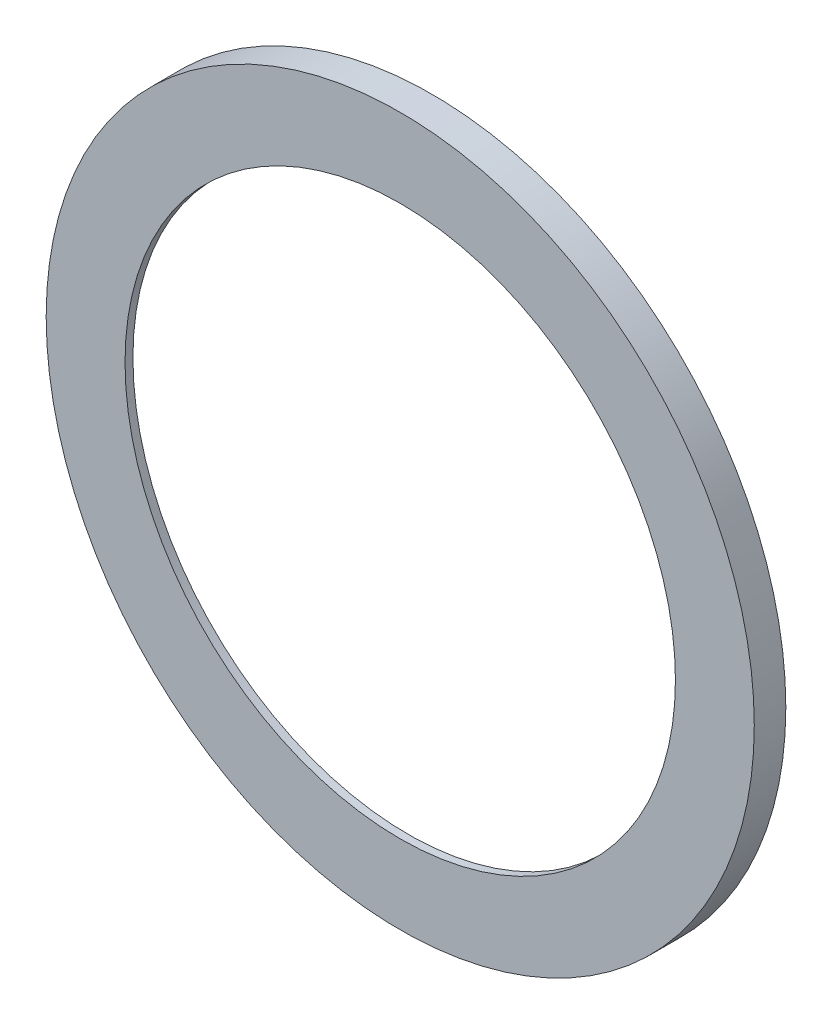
ISO-10303-21;
HEADER;
FILE_DESCRIPTION(('STEP AP214'),'2;1');
FILE_NAME('part.step','',(''),(''),'','','');
FILE_SCHEMA(('AUTOMOTIVE_DESIGN { 1 0 10303 214 1 1 1 1 }'));
ENDSEC;
DATA;
#1=APPLICATION_CONTEXT('core data for automotive mechanical design processes');
#2=APPLICATION_PROTOCOL_DEFINITION('international standard','automotive_design',2000,#1);
#3=PRODUCT_CONTEXT('',#1,'mechanical');
#4=PRODUCT('Part','Part','',(#3));
#5=PRODUCT_RELATED_PRODUCT_CATEGORY('part','',(#4));
#6=PRODUCT_DEFINITION_FORMATION('','',#4);
#7=PRODUCT_DEFINITION_CONTEXT('part definition',#1,'design');
#8=PRODUCT_DEFINITION('design','',#6,#7);
#9=PRODUCT_DEFINITION_SHAPE('','',#8);
#10=(LENGTH_UNIT() NAMED_UNIT(*) SI_UNIT(.MILLI.,.METRE.));
#11=(NAMED_UNIT(*) PLANE_ANGLE_UNIT() SI_UNIT($,.RADIAN.));
#12=(NAMED_UNIT(*) SI_UNIT($,.STERADIAN.) SOLID_ANGLE_UNIT());
#13=UNCERTAINTY_MEASURE_WITH_UNIT(LENGTH_MEASURE(1.E-05),#10,'distance_accuracy_value','');
#14=(GEOMETRIC_REPRESENTATION_CONTEXT(3) GLOBAL_UNCERTAINTY_ASSIGNED_CONTEXT((#13)) GLOBAL_UNIT_ASSIGNED_CONTEXT((#10,
#11,#12)) REPRESENTATION_CONTEXT('',''));
#15=CARTESIAN_POINT('',(0.,0.,0.));
#16=DIRECTION('',(0.,0.,1.));
#17=DIRECTION('',(1.,0.,0.));
#18=AXIS2_PLACEMENT_3D('',#15,#16,#17);
#19=CARTESIAN_POINT('',(0.,0.,20.));
#20=DIRECTION('',(0.,0.,-1.));
#21=DIRECTION('',(-1.,0.,0.));
#22=AXIS2_PLACEMENT_3D('',#19,#20,#21);
#23=CYLINDRICAL_SURFACE('',#22,174.5);
#24=CARTESIAN_POINT('',(0.,0.,20.));
#25=DIRECTION('',(0.,0.,1.));
#26=DIRECTION('',(1.,0.,0.));
#27=AXIS2_PLACEMENT_3D('',#24,#25,#26);
#28=CIRCLE('',#27,174.5);
#29=CARTESIAN_POINT('',(174.5,0.,20.));
#30=VERTEX_POINT('',#29);
#31=EDGE_CURVE('E39',#30,#30,#28,.T.);
#32=ORIENTED_EDGE('',*,*,#31,.T.);
#33=EDGE_LOOP('',(#32));
#34=FACE_BOUND('',#33,.T.);
#35=CARTESIAN_POINT('',(0.,0.,15.));
#36=DIRECTION('',(0.,0.,-1.));
#37=DIRECTION('',(-1.,0.,0.));
#38=AXIS2_PLACEMENT_3D('',#35,#36,#37);
#39=CIRCLE('',#38,174.5);
#40=CARTESIAN_POINT('',(-174.5,0.,15.));
#41=VERTEX_POINT('',#40);
#42=EDGE_CURVE('E47',#41,#41,#39,.T.);
#43=ORIENTED_EDGE('',*,*,#42,.T.);
#44=EDGE_LOOP('',(#43));
#45=FACE_BOUND('',#44,.T.);
#46=ADVANCED_FACE('F28',(#34,#45),#23,.F.);
#47=CARTESIAN_POINT('',(0.,0.,20.));
#48=DIRECTION('',(0.,0.,1.));
#49=DIRECTION('',(1.,0.,0.));
#50=AXIS2_PLACEMENT_3D('',#47,#48,#49);
#51=PLANE('',#50);
#52=CARTESIAN_POINT('',(0.,0.,20.));
#53=DIRECTION('',(0.,0.,1.));
#54=DIRECTION('',(1.,0.,0.));
#55=AXIS2_PLACEMENT_3D('',#52,#53,#54);
#56=CIRCLE('',#55,224.5);
#57=CARTESIAN_POINT('',(224.5,0.,20.));
#58=VERTEX_POINT('',#57);
#59=EDGE_CURVE('E10',#58,#58,#56,.T.);
#60=ORIENTED_EDGE('',*,*,#59,.T.);
#61=EDGE_LOOP('',(#60));
#62=FACE_BOUND('',#61,.T.);
#63=ORIENTED_EDGE('',*,*,#31,.F.);
#64=EDGE_LOOP('',(#63));
#65=FACE_BOUND('',#64,.T.);
#66=ADVANCED_FACE('F69',(#62,#65),#51,.T.);
#67=CARTESIAN_POINT('',(0.,0.,0.));
#68=DIRECTION('',(0.,0.,1.));
#69=DIRECTION('',(1.,0.,0.));
#70=AXIS2_PLACEMENT_3D('',#67,#68,#69);
#71=PLANE('',#70);
#72=CARTESIAN_POINT('',(0.,0.,0.));
#73=DIRECTION('',(0.,0.,-1.));
#74=DIRECTION('',(-1.,0.,0.));
#75=AXIS2_PLACEMENT_3D('',#72,#73,#74);
#76=CIRCLE('',#75,222.);
#77=CARTESIAN_POINT('',(-222.,0.,0.));
#78=VERTEX_POINT('',#77);
#79=EDGE_CURVE('E44',#78,#78,#76,.T.);
#80=ORIENTED_EDGE('',*,*,#79,.F.);
#81=EDGE_LOOP('',(#80));
#82=FACE_BOUND('',#81,.T.);
#83=CARTESIAN_POINT('',(0.,0.,0.));
#84=DIRECTION('',(0.,0.,1.));
#85=DIRECTION('',(1.,0.,0.));
#86=AXIS2_PLACEMENT_3D('',#83,#84,#85);
#87=CIRCLE('',#86,224.5);
#88=CARTESIAN_POINT('',(224.5,0.,0.));
#89=VERTEX_POINT('',#88);
#90=EDGE_CURVE('E32',#89,#89,#87,.T.);
#91=ORIENTED_EDGE('',*,*,#90,.F.);
#92=EDGE_LOOP('',(#91));
#93=FACE_BOUND('',#92,.T.);
#94=ADVANCED_FACE('F66',(#82,#93),#71,.F.);
#95=CARTESIAN_POINT('',(0.,0.,20.));
#96=DIRECTION('',(0.,0.,-1.));
#97=DIRECTION('',(-1.,0.,0.));
#98=AXIS2_PLACEMENT_3D('',#95,#96,#97);
#99=CYLINDRICAL_SURFACE('',#98,224.5);
#100=ORIENTED_EDGE('',*,*,#59,.F.);
#101=EDGE_LOOP('',(#100));
#102=FACE_BOUND('',#101,.T.);
#103=ORIENTED_EDGE('',*,*,#90,.T.);
#104=EDGE_LOOP('',(#103));
#105=FACE_BOUND('',#104,.T.);
#106=ADVANCED_FACE('F30',(#102,#105),#99,.T.);
#107=CARTESIAN_POINT('',(0.,0.,15.));
#108=DIRECTION('',(0.,0.,-1.));
#109=DIRECTION('',(-1.,0.,0.));
#110=AXIS2_PLACEMENT_3D('',#107,#108,#109);
#111=CYLINDRICAL_SURFACE('',#110,222.);
#112=CARTESIAN_POINT('',(0.,0.,15.));
#113=DIRECTION('',(0.,0.,-1.));
#114=DIRECTION('',(-1.,0.,0.));
#115=AXIS2_PLACEMENT_3D('',#112,#113,#114);
#116=CIRCLE('',#115,222.);
#117=CARTESIAN_POINT('',(-222.,0.,15.));
#118=VERTEX_POINT('',#117);
#119=EDGE_CURVE('E43',#118,#118,#116,.T.);
#120=ORIENTED_EDGE('',*,*,#119,.F.);
#121=EDGE_LOOP('',(#120));
#122=FACE_BOUND('',#121,.T.);
#123=ORIENTED_EDGE('',*,*,#79,.T.);
#124=EDGE_LOOP('',(#123));
#125=FACE_BOUND('',#124,.T.);
#126=ADVANCED_FACE('F57',(#122,#125),#111,.F.);
#127=CARTESIAN_POINT('',(0.,0.,15.));
#128=DIRECTION('',(0.,0.,-1.));
#129=DIRECTION('',(-1.,0.,0.));
#130=AXIS2_PLACEMENT_3D('',#127,#128,#129);
#131=PLANE('',#130);
#132=ORIENTED_EDGE('',*,*,#42,.F.);
#133=EDGE_LOOP('',(#132));
#134=FACE_BOUND('',#133,.T.);
#135=ORIENTED_EDGE('',*,*,#119,.T.);
#136=EDGE_LOOP('',(#135));
#137=FACE_BOUND('',#136,.T.);
#138=ADVANCED_FACE('F54',(#134,#137),#131,.T.);
#139=CLOSED_SHELL('',(#46,#66,#94,#106,#126,#138));
#140=MANIFOLD_SOLID_BREP('B2',#139);
#141=ADVANCED_BREP_SHAPE_REPRESENTATION('',(#18,#140),#14);
#142=SHAPE_DEFINITION_REPRESENTATION(#9,#141);
ENDSEC;
END-ISO-10303-21;
